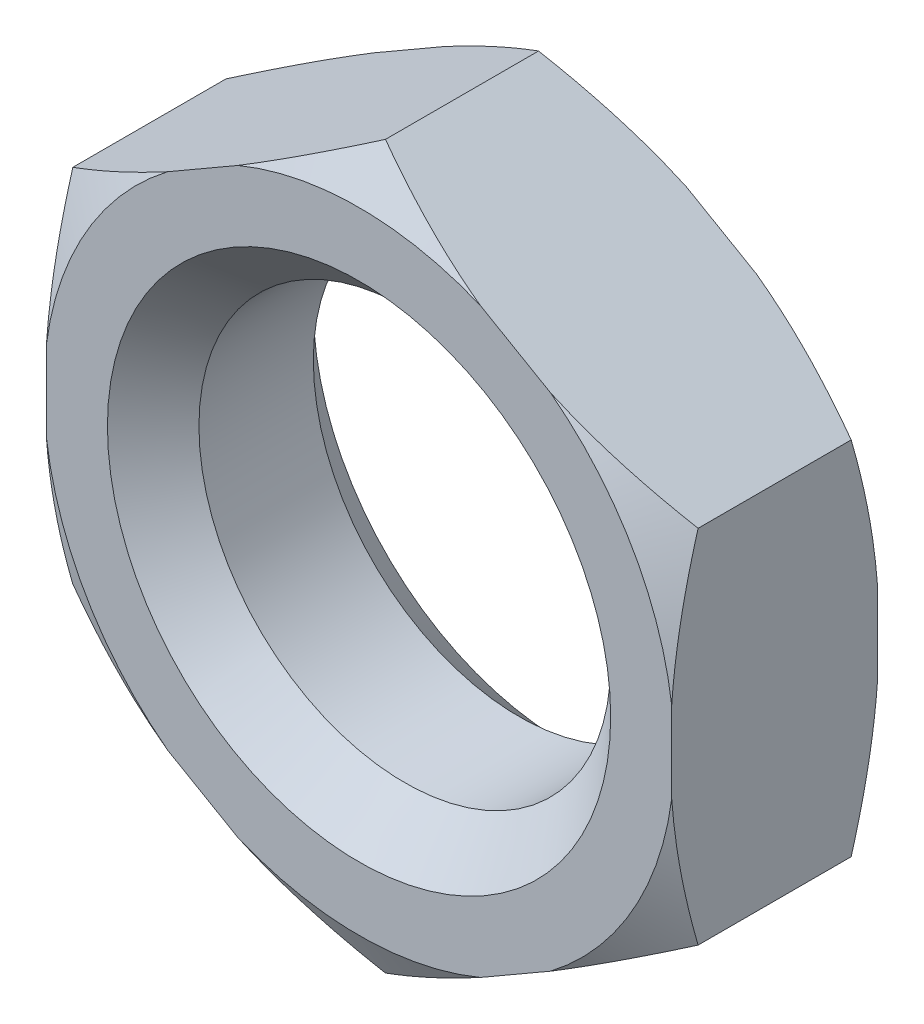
from build123d import *

# Parameters (mm, degrees)
BOSS_EXTRUDE1_DEPTH = 6.75
SKETCH6_R           = 13.5
CUT_EXTRUDE1_DEPTH  = 13.5
CHAMFER1_SIZE       = 3


with BuildPart() as part:
    # Sketch3 → Boss-Extrude1 (new, symmetric)
    with BuildSketch(Plane.XY):
        Polygon((0, 23.671361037), (-20.5, 11.835680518), (-20.5, -11.835680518), (0, -23.671361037), (20.5, -11.835680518), (20.5, 11.835680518), align=None)
    extrude(amount=BOSS_EXTRUDE1_DEPTH, both=True)

    # Sketch5 → Cut-Revolve1 (revolve, cut)
    with BuildSketch(Plane(origin=(0, 0, 0), x_dir=(0, 0, -1), z_dir=(1, 0, 0))):
        Polygon((-6.75, 23.671361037), (-6.75, 20.671361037), (-5.017949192, 23.671361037), align=None)
    cut_revolve1 = revolve(axis=Axis((0, 0, 5.457798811), (0, 0, -1)), mode=Mode.SUBTRACT)

    # Mirror1: Cut-Revolve1 across plane
    add(cut_revolve1.mirror(Plane.XY), mode=Mode.SUBTRACT)

    # Sketch6 → Cut-Extrude1 (cut)
    with BuildSketch(Plane.XY.offset(6.75)):
        Circle(SKETCH6_R)
    extrude(amount=-CUT_EXTRUDE1_DEPTH, mode=Mode.SUBTRACT)

    # Chamfer1
    chamfer1_edges = [part.edges().sort_by_distance(p)[0] for p in [
        (-13.5, 0, -6.75),
        (-13.5, 0, 6.75),
    ]]
    chamfer(chamfer1_edges, length=CHAMFER1_SIZE)


solid = part.part
